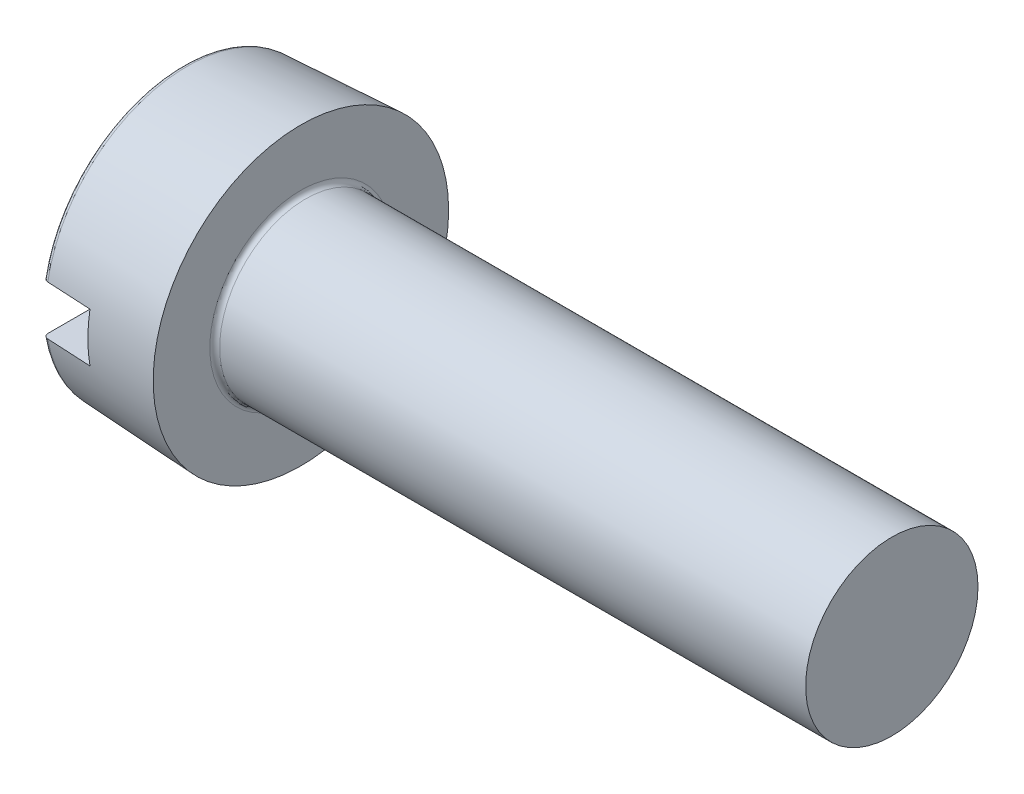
from build123d import *

# Parameters (mm, degrees)
SKETCH2_R       = 3
BASEHEAD_DEPTH  = 2.4
BASEHEAD_DRAFT  = -3
SKETCH3_R       = 1.75
BASEBODY_DEPTH  = 12
SLOT_DEPTH      = 18.282939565
SLOT_DEPTH_BACK = 18.282939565
SKETCH4_W       = 1
SKETCH4_H       = 1
HEADFILLET_R    = 0.1


with BuildPart() as part:
    # Sketch2 → BaseHead (with draft: the straight prism first)
    with BuildSketch(Plane(origin=(2.4, 0, 0), x_dir=(0, 0, -1), z_dir=(1, 0, 0))):
        Circle(SKETCH2_R)
    extrude(amount=-BASEHEAD_DEPTH)
    # BaseHead: the draft: its side faces are tilted about the plane it starts from
    basehead_sides = [part.faces().sort_by_distance(p)[0] for p in [
        (1.2, 0, 3),
    ]]
    draft(basehead_sides, Plane(origin=(2.4, 0, 0), x_dir=(0, 0, -1), z_dir=(1, 0, 0)), BASEHEAD_DRAFT)

    # Sketch3 → BaseBody (add)
    with BuildSketch(Plane(origin=(2.4, -1.110095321, -1.354392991), x_dir=(0, 0, -1), z_dir=(1, 0, 0))):
        with Locations((-1.354392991, 1.110095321)):
            Circle(SKETCH3_R)
    extrude(amount=BASEBODY_DEPTH)

    # Sketch4 → Slot (cut, two sides: drawn at the far end of the back side and taken through both)
    with BuildSketch(Plane(origin=(-1.9, -1.9, 0), x_dir=(0, 1, 0), z_dir=(0, 0, 1)).offset(-SLOT_DEPTH_BACK)):
        with Locations((1.9, -2.4)):
            Rectangle(SKETCH4_W, SKETCH4_H)
    extrude(amount=SLOT_DEPTH + SLOT_DEPTH_BACK, mode=Mode.SUBTRACT)

    # HeadFillet
    headfillet_edges = [part.edges().sort_by_distance(p)[0] for p in [
        (2.4, 0, 1.75),
        (0, -2.87422133, 0),
        (0, 2.87422133, 0),
    ]]
    fillet(headfillet_edges, radius=HEADFILLET_R)


solid = part.part
